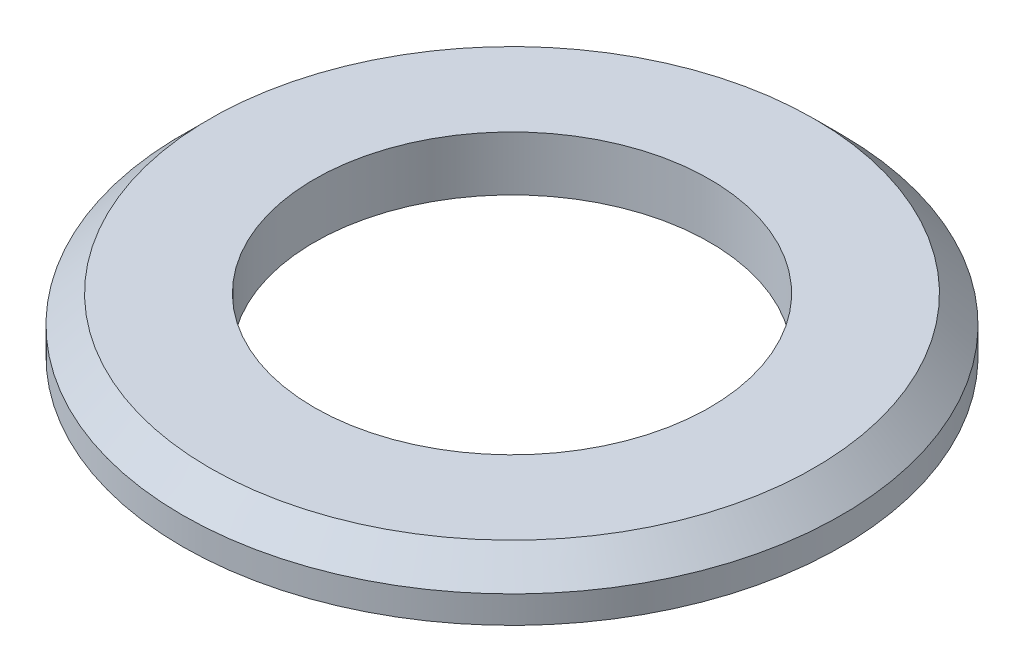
from build123d import *

# Parameters (mm, degrees)
SKETCH1_R      = 72.5
SKETCH1_R_2    = 43.5
EXTRUDE1_DEPTH = 12
CHAMFER1_SIZE  = 6


with BuildPart() as part:
    # Sketch1 → Extrude1 (new body)
    with BuildSketch(Plane(origin=(0, 0, 0), x_dir=(1, 0, 0), z_dir=(0, 1, 0))):
        with Locations(Location((0, 0, 0), (0, 0, 270))):
            Circle(SKETCH1_R)
        with Locations(Location((0, 0, 0), (0, 0, 270))):
            Circle(SKETCH1_R_2, mode=Mode.SUBTRACT)
    extrude(amount=EXTRUDE1_DEPTH)

    # Chamfer1
    chamfer1_edges = [part.edges().sort_by_distance(p)[0] for p in [
        (0, 12, -72.5),
    ]]
    chamfer(chamfer1_edges, length=CHAMFER1_SIZE)


solid = part.part
